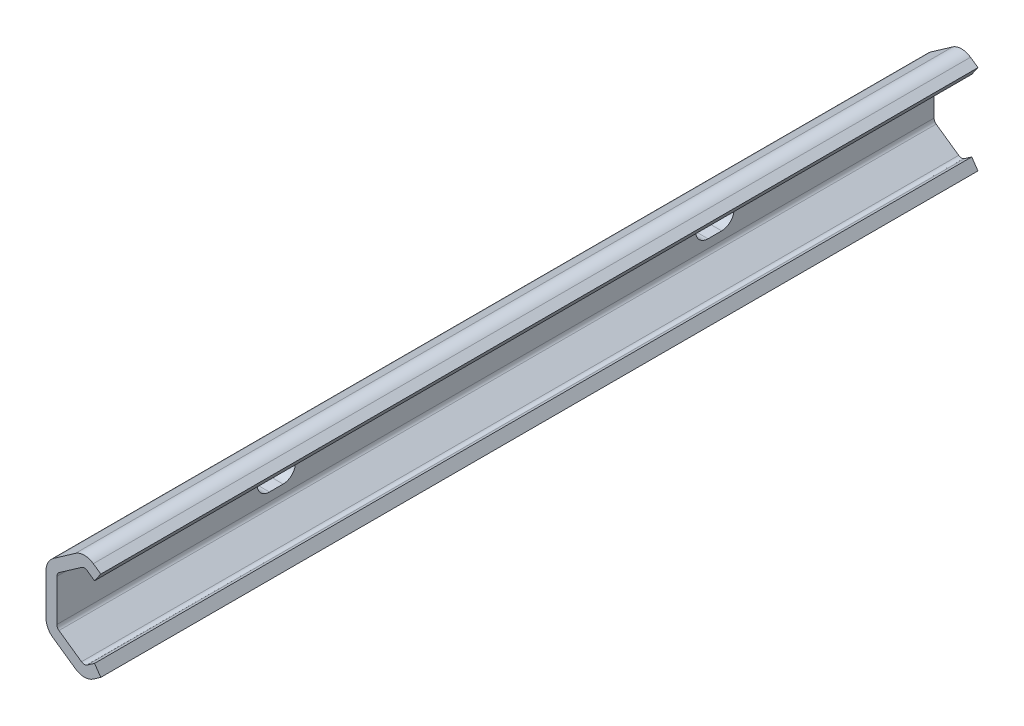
ISO-10303-21;
HEADER;
FILE_DESCRIPTION(('STEP AP214'),'2;1');
FILE_NAME('part.step','',(''),(''),'','','');
FILE_SCHEMA(('AUTOMOTIVE_DESIGN { 1 0 10303 214 1 1 1 1 }'));
ENDSEC;
DATA;
#1=APPLICATION_CONTEXT('core data for automotive mechanical design processes');
#2=APPLICATION_PROTOCOL_DEFINITION('international standard','automotive_design',2000,#1);
#3=PRODUCT_CONTEXT('',#1,'mechanical');
#4=PRODUCT('Part','Part','',(#3));
#5=PRODUCT_RELATED_PRODUCT_CATEGORY('part','',(#4));
#6=PRODUCT_DEFINITION_FORMATION('','',#4);
#7=PRODUCT_DEFINITION_CONTEXT('part definition',#1,'design');
#8=PRODUCT_DEFINITION('design','',#6,#7);
#9=PRODUCT_DEFINITION_SHAPE('','',#8);
#10=(LENGTH_UNIT() NAMED_UNIT(*) SI_UNIT(.MILLI.,.METRE.));
#11=(NAMED_UNIT(*) PLANE_ANGLE_UNIT() SI_UNIT($,.RADIAN.));
#12=(NAMED_UNIT(*) SI_UNIT($,.STERADIAN.) SOLID_ANGLE_UNIT());
#13=UNCERTAINTY_MEASURE_WITH_UNIT(LENGTH_MEASURE(1.E-05),#10,'distance_accuracy_value','');
#14=(GEOMETRIC_REPRESENTATION_CONTEXT(3) GLOBAL_UNCERTAINTY_ASSIGNED_CONTEXT((#13)) GLOBAL_UNIT_ASSIGNED_CONTEXT((#10,
#11,#12)) REPRESENTATION_CONTEXT('',''));
#15=CARTESIAN_POINT('',(0.,0.,0.));
#16=DIRECTION('',(0.,0.,1.));
#17=DIRECTION('',(1.,0.,0.));
#18=AXIS2_PLACEMENT_3D('',#15,#16,#17);
#19=CARTESIAN_POINT('',(7.52196603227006,7.45296627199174,-160.));
#20=DIRECTION('',(-0.573576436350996,-0.819152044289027,0.));
#21=DIRECTION('',(0.819152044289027,-0.573576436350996,0.));
#22=AXIS2_PLACEMENT_3D('',#19,#20,#21);
#23=PLANE('',#22);
#24=DIRECTION('',(0.819152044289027,-0.573576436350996,0.));
#25=VECTOR('',#24,1.);
#26=CARTESIAN_POINT('',(7.52196603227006,7.45296627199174,0.));
#27=LINE('',#26,#25);
#28=CARTESIAN_POINT('',(7.52196603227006,7.45296627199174,0.));
#29=VERTEX_POINT('',#28);
#30=CARTESIAN_POINT('',(8.85284712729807,6.52107329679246,0.));
#31=VERTEX_POINT('',#30);
#32=EDGE_CURVE('E309',#29,#31,#27,.T.);
#33=ORIENTED_EDGE('',*,*,#32,.F.);
#34=DIRECTION('',(0.,0.,1.));
#35=VECTOR('',#34,1.);
#36=CARTESIAN_POINT('',(7.52196603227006,7.45296627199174,-160.));
#37=LINE('',#36,#35);
#38=CARTESIAN_POINT('',(7.52196603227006,7.45296627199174,-160.));
#39=VERTEX_POINT('',#38);
#40=EDGE_CURVE('E11',#39,#29,#37,.T.);
#41=ORIENTED_EDGE('',*,*,#40,.F.);
#42=DIRECTION('',(0.819152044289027,-0.573576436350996,0.));
#43=VECTOR('',#42,1.);
#44=CARTESIAN_POINT('',(7.52196603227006,7.45296627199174,-160.));
#45=LINE('',#44,#43);
#46=CARTESIAN_POINT('',(8.85284712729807,6.52107329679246,-160.));
#47=VERTEX_POINT('',#46);
#48=EDGE_CURVE('E319',#39,#47,#45,.T.);
#49=ORIENTED_EDGE('',*,*,#48,.T.);
#50=DIRECTION('',(0.,0.,1.));
#51=VECTOR('',#50,1.);
#52=CARTESIAN_POINT('',(8.85284712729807,6.52107329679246,-160.));
#53=LINE('',#52,#51);
#54=EDGE_CURVE('E41',#47,#31,#53,.T.);
#55=ORIENTED_EDGE('',*,*,#54,.T.);
#56=EDGE_LOOP('',(#33,#41,#49,#55));
#57=FACE_BOUND('',#56,.T.);
#58=ADVANCED_FACE('F38',(#57),#23,.T.);
#59=CARTESIAN_POINT('',(7.00000000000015,6.70752152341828,-160.));
#60=DIRECTION('',(0.,0.,1.));
#61=DIRECTION('',(1.,0.,0.));
#62=AXIS2_PLACEMENT_3D('',#59,#60,#61);
#63=CYLINDRICAL_SURFACE('',#62,0.910020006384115);
#64=CARTESIAN_POINT('',(7.00000000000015,6.70752152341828,0.));
#65=DIRECTION('',(0.,0.,-1.));
#66=DIRECTION('',(-1.,0.,0.));
#67=AXIS2_PLACEMENT_3D('',#64,#65,#66);
#68=CIRCLE('',#67,0.910020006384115);
#69=CARTESIAN_POINT('',(6.47803396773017,7.4529662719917,0.));
#70=VERTEX_POINT('',#69);
#71=EDGE_CURVE('E324',#70,#29,#68,.T.);
#72=ORIENTED_EDGE('',*,*,#71,.F.);
#73=DIRECTION('',(0.,0.,1.));
#74=VECTOR('',#73,1.);
#75=CARTESIAN_POINT('',(6.47803396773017,7.4529662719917,-160.));
#76=LINE('',#75,#74);
#77=CARTESIAN_POINT('',(6.47803396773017,7.4529662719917,-160.));
#78=VERTEX_POINT('',#77);
#79=EDGE_CURVE('E47',#78,#70,#76,.T.);
#80=ORIENTED_EDGE('',*,*,#79,.F.);
#81=CARTESIAN_POINT('',(7.00000000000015,6.70752152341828,-160.));
#82=DIRECTION('',(0.,0.,-1.));
#83=DIRECTION('',(-1.,0.,0.));
#84=AXIS2_PLACEMENT_3D('',#81,#82,#83);
#85=CIRCLE('',#84,0.910020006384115);
#86=EDGE_CURVE('E395',#78,#39,#85,.T.);
#87=ORIENTED_EDGE('',*,*,#86,.T.);
#88=ORIENTED_EDGE('',*,*,#40,.T.);
#89=EDGE_LOOP('',(#72,#80,#87,#88));
#90=FACE_BOUND('',#89,.T.);
#91=ADVANCED_FACE('F541',(#90),#63,.F.);
#92=CARTESIAN_POINT('',(2.36906085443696,4.57583232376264,-160.));
#93=DIRECTION('',(0.573576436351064,-0.819152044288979,0.));
#94=DIRECTION('',(0.819152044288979,0.573576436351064,0.));
#95=AXIS2_PLACEMENT_3D('',#92,#93,#94);
#96=PLANE('',#95);
#97=DIRECTION('',(0.819152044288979,0.573576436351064,0.));
#98=VECTOR('',#97,1.);
#99=CARTESIAN_POINT('',(2.36906085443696,4.57583232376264,0.));
#100=LINE('',#99,#98);
#101=CARTESIAN_POINT('',(2.36906085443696,4.57583232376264,0.));
#102=VERTEX_POINT('',#101);
#103=EDGE_CURVE('E470',#102,#70,#100,.T.);
#104=ORIENTED_EDGE('',*,*,#103,.F.);
#105=DIRECTION('',(0.,0.,1.));
#106=VECTOR('',#105,1.);
#107=CARTESIAN_POINT('',(2.36906085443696,4.57583232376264,-160.));
#108=LINE('',#107,#106);
#109=CARTESIAN_POINT('',(2.36906085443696,4.57583232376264,-160.));
#110=VERTEX_POINT('',#109);
#111=EDGE_CURVE('E479',#110,#102,#108,.T.);
#112=ORIENTED_EDGE('',*,*,#111,.F.);
#113=DIRECTION('',(0.819152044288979,0.573576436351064,0.));
#114=VECTOR('',#113,1.);
#115=CARTESIAN_POINT('',(2.36906085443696,4.57583232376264,-160.));
#116=LINE('',#115,#114);
#117=EDGE_CURVE('E391',#110,#78,#116,.T.);
#118=ORIENTED_EDGE('',*,*,#117,.T.);
#119=ORIENTED_EDGE('',*,*,#79,.T.);
#120=EDGE_LOOP('',(#104,#112,#118,#119));
#121=FACE_BOUND('',#120,.T.);
#122=ADVANCED_FACE('F609',(#121),#96,.T.);
#123=CARTESIAN_POINT('',(3.00000000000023,3.79999999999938,-160.));
#124=DIRECTION('',(0.,0.,1.));
#125=DIRECTION('',(1.,0.,0.));
#126=AXIS2_PLACEMENT_3D('',#123,#124,#125);
#127=CYLINDRICAL_SURFACE('',#126,1.);
#128=CARTESIAN_POINT('',(3.00000000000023,3.79999999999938,0.));
#129=DIRECTION('',(0.,0.,-1.));
#130=DIRECTION('',(-1.,0.,0.));
#131=AXIS2_PLACEMENT_3D('',#128,#129,#130);
#132=CIRCLE('',#131,1.);
#133=CARTESIAN_POINT('',(2.00000000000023,3.79999999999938,0.));
#134=VERTEX_POINT('',#133);
#135=EDGE_CURVE('E466',#134,#102,#132,.T.);
#136=ORIENTED_EDGE('',*,*,#135,.F.);
#137=DIRECTION('',(0.,0.,1.));
#138=VECTOR('',#137,1.);
#139=CARTESIAN_POINT('',(2.00000000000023,3.79999999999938,-160.));
#140=LINE('',#139,#138);
#141=CARTESIAN_POINT('',(2.00000000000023,3.79999999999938,-160.));
#142=VERTEX_POINT('',#141);
#143=EDGE_CURVE('E482',#142,#134,#140,.T.);
#144=ORIENTED_EDGE('',*,*,#143,.F.);
#145=CARTESIAN_POINT('',(3.00000000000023,3.79999999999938,-160.));
#146=DIRECTION('',(0.,0.,-1.));
#147=DIRECTION('',(-1.,0.,0.));
#148=AXIS2_PLACEMENT_3D('',#145,#146,#147);
#149=CIRCLE('',#148,1.);
#150=EDGE_CURVE('E387',#142,#110,#149,.T.);
#151=ORIENTED_EDGE('',*,*,#150,.T.);
#152=ORIENTED_EDGE('',*,*,#111,.T.);
#153=EDGE_LOOP('',(#136,#144,#151,#152));
#154=FACE_BOUND('',#153,.T.);
#155=ADVANCED_FACE('F607',(#154),#127,.F.);
#156=CARTESIAN_POINT('',(2.00000000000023,-3.80000000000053,-160.));
#157=DIRECTION('',(1.,0.,0.));
#158=DIRECTION('',(0.,1.,0.));
#159=AXIS2_PLACEMENT_3D('',#156,#157,#158);
#160=PLANE('',#159);
#161=CARTESIAN_POINT('',(2.00000000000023,0.,-118.75));
#162=DIRECTION('',(1.,0.,0.));
#163=DIRECTION('',(0.,1.,0.));
#164=AXIS2_PLACEMENT_3D('',#161,#162,#163);
#165=CIRCLE('',#164,2.25);
#166=CARTESIAN_POINT('',(2.00000000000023,2.25,-118.75));
#167=VERTEX_POINT('',#166);
#168=CARTESIAN_POINT('',(2.00000000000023,-2.25,-118.75));
#169=VERTEX_POINT('',#168);
#170=EDGE_CURVE('E55',#167,#169,#165,.T.);
#171=ORIENTED_EDGE('',*,*,#170,.F.);
#172=DIRECTION('',(0.,0.,1.));
#173=VECTOR('',#172,1.);
#174=CARTESIAN_POINT('',(2.00000000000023,2.25,-118.75));
#175=LINE('',#174,#173);
#176=CARTESIAN_POINT('',(2.00000000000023,2.25,-121.25));
#177=VERTEX_POINT('',#176);
#178=EDGE_CURVE('E245',#177,#167,#175,.T.);
#179=ORIENTED_EDGE('',*,*,#178,.F.);
#180=CARTESIAN_POINT('',(2.00000000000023,0.,-121.25));
#181=DIRECTION('',(1.,0.,0.));
#182=DIRECTION('',(0.,1.,0.));
#183=AXIS2_PLACEMENT_3D('',#180,#181,#182);
#184=CIRCLE('',#183,2.25);
#185=CARTESIAN_POINT('',(2.00000000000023,-2.25,-121.25));
#186=VERTEX_POINT('',#185);
#187=EDGE_CURVE('E251',#186,#177,#184,.T.);
#188=ORIENTED_EDGE('',*,*,#187,.F.);
#189=DIRECTION('',(0.,0.,-1.));
#190=VECTOR('',#189,1.);
#191=CARTESIAN_POINT('',(2.00000000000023,-2.25,-118.75));
#192=LINE('',#191,#190);
#193=EDGE_CURVE('E260',#169,#186,#192,.T.);
#194=ORIENTED_EDGE('',*,*,#193,.F.);
#195=EDGE_LOOP('',(#171,#179,#188,#194));
#196=FACE_BOUND('',#195,.T.);
#197=CARTESIAN_POINT('',(2.00000000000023,0.,-38.75));
#198=DIRECTION('',(1.,0.,0.));
#199=DIRECTION('',(0.,1.,0.));
#200=AXIS2_PLACEMENT_3D('',#197,#198,#199);
#201=CIRCLE('',#200,2.25);
#202=CARTESIAN_POINT('',(2.00000000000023,2.25,-38.75));
#203=VERTEX_POINT('',#202);
#204=CARTESIAN_POINT('',(2.00000000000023,-2.25,-38.75));
#205=VERTEX_POINT('',#204);
#206=EDGE_CURVE('E269',#203,#205,#201,.T.);
#207=ORIENTED_EDGE('',*,*,#206,.F.);
#208=DIRECTION('',(0.,0.,1.));
#209=VECTOR('',#208,1.);
#210=CARTESIAN_POINT('',(2.00000000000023,2.25,-38.75));
#211=LINE('',#210,#209);
#212=CARTESIAN_POINT('',(2.00000000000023,2.25,-41.25));
#213=VERTEX_POINT('',#212);
#214=EDGE_CURVE('E280',#213,#203,#211,.T.);
#215=ORIENTED_EDGE('',*,*,#214,.F.);
#216=CARTESIAN_POINT('',(2.00000000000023,0.,-41.25));
#217=DIRECTION('',(1.,0.,0.));
#218=DIRECTION('',(0.,1.,0.));
#219=AXIS2_PLACEMENT_3D('',#216,#217,#218);
#220=CIRCLE('',#219,2.25);
#221=CARTESIAN_POINT('',(2.00000000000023,-2.25,-41.25));
#222=VERTEX_POINT('',#221);
#223=EDGE_CURVE('E299',#222,#213,#220,.T.);
#224=ORIENTED_EDGE('',*,*,#223,.F.);
#225=DIRECTION('',(0.,0.,-1.));
#226=VECTOR('',#225,1.);
#227=CARTESIAN_POINT('',(2.00000000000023,-2.25,-38.75));
#228=LINE('',#227,#226);
#229=EDGE_CURVE('E295',#205,#222,#228,.T.);
#230=ORIENTED_EDGE('',*,*,#229,.F.);
#231=EDGE_LOOP('',(#207,#215,#224,#230));
#232=FACE_BOUND('',#231,.T.);
#233=DIRECTION('',(0.,1.,0.));
#234=VECTOR('',#233,1.);
#235=CARTESIAN_POINT('',(2.00000000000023,-3.80000000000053,0.));
#236=LINE('',#235,#234);
#237=CARTESIAN_POINT('',(2.00000000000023,-3.80000000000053,0.));
#238=VERTEX_POINT('',#237);
#239=EDGE_CURVE('E462',#238,#134,#236,.T.);
#240=ORIENTED_EDGE('',*,*,#239,.F.);
#241=DIRECTION('',(0.,0.,1.));
#242=VECTOR('',#241,1.);
#243=CARTESIAN_POINT('',(2.00000000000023,-3.80000000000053,-160.));
#244=LINE('',#243,#242);
#245=CARTESIAN_POINT('',(2.00000000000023,-3.80000000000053,-160.));
#246=VERTEX_POINT('',#245);
#247=EDGE_CURVE('E485',#246,#238,#244,.T.);
#248=ORIENTED_EDGE('',*,*,#247,.F.);
#249=DIRECTION('',(0.,1.,0.));
#250=VECTOR('',#249,1.);
#251=CARTESIAN_POINT('',(2.00000000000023,-3.80000000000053,-160.));
#252=LINE('',#251,#250);
#253=EDGE_CURVE('E383',#246,#142,#252,.T.);
#254=ORIENTED_EDGE('',*,*,#253,.T.);
#255=ORIENTED_EDGE('',*,*,#143,.T.);
#256=EDGE_LOOP('',(#240,#248,#254,#255));
#257=FACE_BOUND('',#256,.T.);
#258=ADVANCED_FACE('F603',(#196,#232,#257),#160,.T.);
#259=CARTESIAN_POINT('',(2.86850545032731,-3.86255151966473,-160.));
#260=DIRECTION('',(0.,0.,1.));
#261=DIRECTION('',(1.,0.,0.));
#262=AXIS2_PLACEMENT_3D('',#259,#260,#261);
#263=CYLINDRICAL_SURFACE('',#262,0.870755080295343);
#264=CARTESIAN_POINT('',(2.86850545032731,-3.86255151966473,0.));
#265=DIRECTION('',(0.,0.,-1.));
#266=DIRECTION('',(-1.,0.,0.));
#267=AXIS2_PLACEMENT_3D('',#264,#265,#266);
#268=CIRCLE('',#267,0.870755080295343);
#269=CARTESIAN_POINT('',(2.36906085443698,-4.57583232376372,0.));
#270=VERTEX_POINT('',#269);
#271=EDGE_CURVE('E458',#270,#238,#268,.T.);
#272=ORIENTED_EDGE('',*,*,#271,.F.);
#273=DIRECTION('',(0.,0.,1.));
#274=VECTOR('',#273,1.);
#275=CARTESIAN_POINT('',(2.36906085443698,-4.57583232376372,-160.));
#276=LINE('',#275,#274);
#277=CARTESIAN_POINT('',(2.36906085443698,-4.57583232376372,-160.));
#278=VERTEX_POINT('',#277);
#279=EDGE_CURVE('E488',#278,#270,#276,.T.);
#280=ORIENTED_EDGE('',*,*,#279,.F.);
#281=CARTESIAN_POINT('',(2.86850545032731,-3.86255151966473,-160.));
#282=DIRECTION('',(0.,0.,-1.));
#283=DIRECTION('',(-1.,0.,0.));
#284=AXIS2_PLACEMENT_3D('',#281,#282,#283);
#285=CIRCLE('',#284,0.870755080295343);
#286=EDGE_CURVE('E379',#278,#246,#285,.T.);
#287=ORIENTED_EDGE('',*,*,#286,.T.);
#288=ORIENTED_EDGE('',*,*,#247,.T.);
#289=EDGE_LOOP('',(#272,#280,#287,#288));
#290=FACE_BOUND('',#289,.T.);
#291=ADVANCED_FACE('F599',(#290),#263,.F.);
#292=CARTESIAN_POINT('',(6.47803396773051,-7.45296627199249,-160.));
#293=DIRECTION('',(0.573576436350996,0.819152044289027,0.));
#294=DIRECTION('',(-0.819152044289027,0.573576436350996,0.));
#295=AXIS2_PLACEMENT_3D('',#292,#293,#294);
#296=PLANE('',#295);
#297=DIRECTION('',(-0.819152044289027,0.573576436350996,0.));
#298=VECTOR('',#297,1.);
#299=CARTESIAN_POINT('',(6.47803396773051,-7.45296627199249,0.));
#300=LINE('',#299,#298);
#301=CARTESIAN_POINT('',(6.47803396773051,-7.45296627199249,0.));
#302=VERTEX_POINT('',#301);
#303=EDGE_CURVE('E454',#302,#270,#300,.T.);
#304=ORIENTED_EDGE('',*,*,#303,.F.);
#305=DIRECTION('',(0.,0.,1.));
#306=VECTOR('',#305,1.);
#307=CARTESIAN_POINT('',(6.47803396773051,-7.45296627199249,-160.));
#308=LINE('',#307,#306);
#309=CARTESIAN_POINT('',(6.47803396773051,-7.45296627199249,-160.));
#310=VERTEX_POINT('',#309);
#311=EDGE_CURVE('E491',#310,#302,#308,.T.);
#312=ORIENTED_EDGE('',*,*,#311,.F.);
#313=DIRECTION('',(-0.819152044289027,0.573576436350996,0.));
#314=VECTOR('',#313,1.);
#315=CARTESIAN_POINT('',(6.47803396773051,-7.45296627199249,-160.));
#316=LINE('',#315,#314);
#317=EDGE_CURVE('E375',#310,#278,#316,.T.);
#318=ORIENTED_EDGE('',*,*,#317,.T.);
#319=ORIENTED_EDGE('',*,*,#279,.T.);
#320=EDGE_LOOP('',(#304,#312,#318,#319));
#321=FACE_BOUND('',#320,.T.);
#322=ADVANCED_FACE('F595',(#321),#296,.T.);
#323=CARTESIAN_POINT('',(7.00000000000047,-6.70752152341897,-160.));
#324=DIRECTION('',(0.,0.,1.));
#325=DIRECTION('',(1.,0.,0.));
#326=AXIS2_PLACEMENT_3D('',#323,#324,#325);
#327=CYLINDRICAL_SURFACE('',#326,0.910020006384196);
#328=CARTESIAN_POINT('',(7.00000000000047,-6.70752152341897,0.));
#329=DIRECTION('',(0.,0.,-1.));
#330=DIRECTION('',(-1.,0.,0.));
#331=AXIS2_PLACEMENT_3D('',#328,#329,#330);
#332=CIRCLE('',#331,0.910020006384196);
#333=CARTESIAN_POINT('',(7.52196603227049,-7.45296627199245,0.));
#334=VERTEX_POINT('',#333);
#335=EDGE_CURVE('E450',#334,#302,#332,.T.);
#336=ORIENTED_EDGE('',*,*,#335,.F.);
#337=DIRECTION('',(0.,0.,1.));
#338=VECTOR('',#337,1.);
#339=CARTESIAN_POINT('',(7.52196603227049,-7.45296627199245,-160.));
#340=LINE('',#339,#338);
#341=CARTESIAN_POINT('',(7.52196603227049,-7.45296627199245,-160.));
#342=VERTEX_POINT('',#341);
#343=EDGE_CURVE('E494',#342,#334,#340,.T.);
#344=ORIENTED_EDGE('',*,*,#343,.F.);
#345=CARTESIAN_POINT('',(7.00000000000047,-6.70752152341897,-160.));
#346=DIRECTION('',(0.,0.,-1.));
#347=DIRECTION('',(-1.,0.,0.));
#348=AXIS2_PLACEMENT_3D('',#345,#346,#347);
#349=CIRCLE('',#348,0.910020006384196);
#350=EDGE_CURVE('E372',#342,#310,#349,.T.);
#351=ORIENTED_EDGE('',*,*,#350,.T.);
#352=ORIENTED_EDGE('',*,*,#311,.T.);
#353=EDGE_LOOP('',(#336,#344,#351,#352));
#354=FACE_BOUND('',#353,.T.);
#355=ADVANCED_FACE('F591',(#354),#327,.F.);
#356=CARTESIAN_POINT('',(8.85284712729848,-6.52107329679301,-160.));
#357=DIRECTION('',(-0.573576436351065,0.819152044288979,0.));
#358=DIRECTION('',(-0.819152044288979,-0.573576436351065,0.));
#359=AXIS2_PLACEMENT_3D('',#356,#357,#358);
#360=PLANE('',#359);
#361=DIRECTION('',(-0.819152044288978,-0.573576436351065,0.));
#362=VECTOR('',#361,1.);
#363=CARTESIAN_POINT('',(8.85284712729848,-6.52107329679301,0.));
#364=LINE('',#363,#362);
#365=CARTESIAN_POINT('',(8.85284712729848,-6.52107329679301,0.));
#366=VERTEX_POINT('',#365);
#367=EDGE_CURVE('E446',#366,#334,#364,.T.);
#368=ORIENTED_EDGE('',*,*,#367,.F.);
#369=DIRECTION('',(0.,0.,1.));
#370=VECTOR('',#369,1.);
#371=CARTESIAN_POINT('',(8.85284712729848,-6.52107329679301,-160.));
#372=LINE('',#371,#370);
#373=CARTESIAN_POINT('',(8.85284712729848,-6.52107329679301,-160.));
#374=VERTEX_POINT('',#373);
#375=EDGE_CURVE('E497',#374,#366,#372,.T.);
#376=ORIENTED_EDGE('',*,*,#375,.F.);
#377=DIRECTION('',(-0.819152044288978,-0.573576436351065,0.));
#378=VECTOR('',#377,1.);
#379=CARTESIAN_POINT('',(8.85284712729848,-6.52107329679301,-160.));
#380=LINE('',#379,#378);
#381=EDGE_CURVE('E368',#374,#342,#380,.T.);
#382=ORIENTED_EDGE('',*,*,#381,.T.);
#383=ORIENTED_EDGE('',*,*,#343,.T.);
#384=EDGE_LOOP('',(#368,#376,#382,#383));
#385=FACE_BOUND('',#384,.T.);
#386=ADVANCED_FACE('F587',(#385),#360,.T.);
#387=CARTESIAN_POINT('',(10.0000000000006,-8.15937738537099,-160.));
#388=DIRECTION('',(0.819152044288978,0.573576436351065,0.));
#389=DIRECTION('',(-0.573576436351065,0.819152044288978,0.));
#390=AXIS2_PLACEMENT_3D('',#387,#388,#389);
#391=PLANE('',#390);
#392=DIRECTION('',(-0.573576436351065,0.819152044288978,0.));
#393=VECTOR('',#392,1.);
#394=CARTESIAN_POINT('',(10.0000000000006,-8.15937738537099,0.));
#395=LINE('',#394,#393);
#396=CARTESIAN_POINT('',(10.0000000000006,-8.15937738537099,0.));
#397=VERTEX_POINT('',#396);
#398=EDGE_CURVE('E442',#397,#366,#395,.T.);
#399=ORIENTED_EDGE('',*,*,#398,.F.);
#400=DIRECTION('',(0.,0.,1.));
#401=VECTOR('',#400,1.);
#402=CARTESIAN_POINT('',(10.0000000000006,-8.15937738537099,-160.));
#403=LINE('',#402,#401);
#404=CARTESIAN_POINT('',(10.0000000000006,-8.15937738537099,-160.));
#405=VERTEX_POINT('',#404);
#406=EDGE_CURVE('E500',#405,#397,#403,.T.);
#407=ORIENTED_EDGE('',*,*,#406,.F.);
#408=DIRECTION('',(-0.573576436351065,0.819152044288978,0.));
#409=VECTOR('',#408,1.);
#410=CARTESIAN_POINT('',(10.0000000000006,-8.15937738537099,-160.));
#411=LINE('',#410,#409);
#412=EDGE_CURVE('E364',#405,#374,#411,.T.);
#413=ORIENTED_EDGE('',*,*,#412,.T.);
#414=ORIENTED_EDGE('',*,*,#375,.T.);
#415=EDGE_LOOP('',(#399,#407,#413,#414));
#416=FACE_BOUND('',#415,.T.);
#417=ADVANCED_FACE('F583',(#416),#391,.T.);
#418=CARTESIAN_POINT('',(8.63210894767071,-9.11718501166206,-160.));
#419=DIRECTION('',(0.573576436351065,-0.819152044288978,0.));
#420=DIRECTION('',(0.819152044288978,0.573576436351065,0.));
#421=AXIS2_PLACEMENT_3D('',#418,#419,#420);
#422=PLANE('',#421);
#423=DIRECTION('',(0.819152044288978,0.573576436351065,0.));
#424=VECTOR('',#423,1.);
#425=CARTESIAN_POINT('',(8.63210894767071,-9.11718501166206,0.));
#426=LINE('',#425,#424);
#427=CARTESIAN_POINT('',(8.63210894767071,-9.11718501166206,0.));
#428=VERTEX_POINT('',#427);
#429=EDGE_CURVE('E438',#428,#397,#426,.T.);
#430=ORIENTED_EDGE('',*,*,#429,.F.);
#431=DIRECTION('',(0.,0.,1.));
#432=VECTOR('',#431,1.);
#433=CARTESIAN_POINT('',(8.63210894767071,-9.11718501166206,-160.));
#434=LINE('',#433,#432);
#435=CARTESIAN_POINT('',(8.63210894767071,-9.11718501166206,-160.));
#436=VERTEX_POINT('',#435);
#437=EDGE_CURVE('E503',#436,#428,#434,.T.);
#438=ORIENTED_EDGE('',*,*,#437,.F.);
#439=DIRECTION('',(0.819152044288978,0.573576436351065,0.));
#440=VECTOR('',#439,1.);
#441=CARTESIAN_POINT('',(8.63210894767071,-9.11718501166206,-160.));
#442=LINE('',#441,#440);
#443=EDGE_CURVE('E360',#436,#405,#442,.T.);
#444=ORIENTED_EDGE('',*,*,#443,.T.);
#445=ORIENTED_EDGE('',*,*,#406,.T.);
#446=EDGE_LOOP('',(#430,#438,#444,#445));
#447=FACE_BOUND('',#446,.T.);
#448=ADVANCED_FACE('F579',(#447),#422,.T.);
#449=CARTESIAN_POINT('',(7.00000000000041,-6.78629187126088,-160.));
#450=DIRECTION('',(0.,0.,1.));
#451=DIRECTION('',(1.,0.,0.));
#452=AXIS2_PLACEMENT_3D('',#449,#450,#451);
#453=CYLINDRICAL_SURFACE('',#452,2.84549511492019);
#454=CARTESIAN_POINT('',(7.00000000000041,-6.78629187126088,0.));
#455=DIRECTION('',(0.,0.,1.));
#456=DIRECTION('',(1.,0.,0.));
#457=AXIS2_PLACEMENT_3D('',#454,#455,#456);
#458=CIRCLE('',#457,2.84549511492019);
#459=CARTESIAN_POINT('',(5.36789105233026,-9.11718501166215,0.));
#460=VERTEX_POINT('',#459);
#461=EDGE_CURVE('E434',#460,#428,#458,.T.);
#462=ORIENTED_EDGE('',*,*,#461,.F.);
#463=DIRECTION('',(0.,0.,1.));
#464=VECTOR('',#463,1.);
#465=CARTESIAN_POINT('',(5.36789105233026,-9.11718501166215,-160.));
#466=LINE('',#465,#464);
#467=CARTESIAN_POINT('',(5.36789105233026,-9.11718501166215,-160.));
#468=VERTEX_POINT('',#467);
#469=EDGE_CURVE('E506',#468,#460,#466,.T.);
#470=ORIENTED_EDGE('',*,*,#469,.F.);
#471=CARTESIAN_POINT('',(7.00000000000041,-6.78629187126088,-160.));
#472=DIRECTION('',(0.,0.,1.));
#473=DIRECTION('',(1.,0.,0.));
#474=AXIS2_PLACEMENT_3D('',#471,#472,#473);
#475=CIRCLE('',#474,2.84549511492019);
#476=EDGE_CURVE('E356',#468,#436,#475,.T.);
#477=ORIENTED_EDGE('',*,*,#476,.T.);
#478=ORIENTED_EDGE('',*,*,#437,.T.);
#479=EDGE_LOOP('',(#462,#470,#477,#478));
#480=FACE_BOUND('',#479,.T.);
#481=ADVANCED_FACE('F575',(#480),#453,.T.);
#482=CARTESIAN_POINT('',(1.382718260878,-6.32673698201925,-160.));
#483=DIRECTION('',(-0.573576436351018,-0.819152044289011,0.));
#484=DIRECTION('',(0.819152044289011,-0.573576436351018,0.));
#485=AXIS2_PLACEMENT_3D('',#482,#483,#484);
#486=PLANE('',#485);
#487=DIRECTION('',(0.819152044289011,-0.573576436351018,0.));
#488=VECTOR('',#487,1.);
#489=CARTESIAN_POINT('',(1.382718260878,-6.32673698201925,0.));
#490=LINE('',#489,#488);
#491=CARTESIAN_POINT('',(1.382718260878,-6.32673698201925,0.));
#492=VERTEX_POINT('',#491);
#493=EDGE_CURVE('E430',#492,#460,#490,.T.);
#494=ORIENTED_EDGE('',*,*,#493,.F.);
#495=DIRECTION('',(0.,0.,1.));
#496=VECTOR('',#495,1.);
#497=CARTESIAN_POINT('',(1.382718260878,-6.32673698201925,-160.));
#498=LINE('',#497,#496);
#499=CARTESIAN_POINT('',(1.382718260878,-6.32673698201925,-160.));
#500=VERTEX_POINT('',#499);
#501=EDGE_CURVE('E509',#500,#492,#498,.T.);
#502=ORIENTED_EDGE('',*,*,#501,.F.);
#503=DIRECTION('',(0.819152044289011,-0.573576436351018,0.));
#504=VECTOR('',#503,1.);
#505=CARTESIAN_POINT('',(1.382718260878,-6.32673698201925,-160.));
#506=LINE('',#505,#504);
#507=EDGE_CURVE('E352',#500,#468,#506,.T.);
#508=ORIENTED_EDGE('',*,*,#507,.T.);
#509=ORIENTED_EDGE('',*,*,#469,.T.);
#510=EDGE_LOOP('',(#494,#502,#508,#509));
#511=FACE_BOUND('',#510,.T.);
#512=ADVANCED_FACE('F571',(#511),#486,.T.);
#513=CARTESIAN_POINT('',(3.00000000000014,-3.80000000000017,-160.));
#514=DIRECTION('',(0.,0.,1.));
#515=DIRECTION('',(1.,0.,0.));
#516=AXIS2_PLACEMENT_3D('',#513,#514,#515);
#517=CYLINDRICAL_SURFACE('',#516,3.00000000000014);
#518=CARTESIAN_POINT('',(3.00000000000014,-3.80000000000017,0.));
#519=DIRECTION('',(0.,0.,1.));
#520=DIRECTION('',(1.,0.,0.));
#521=AXIS2_PLACEMENT_3D('',#518,#519,#520);
#522=CIRCLE('',#521,3.00000000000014);
#523=CARTESIAN_POINT('',(0.,-3.80000000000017,0.));
#524=VERTEX_POINT('',#523);
#525=EDGE_CURVE('E426',#524,#492,#522,.T.);
#526=ORIENTED_EDGE('',*,*,#525,.F.);
#527=DIRECTION('',(0.,0.,1.));
#528=VECTOR('',#527,1.);
#529=CARTESIAN_POINT('',(0.,-3.80000000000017,-160.));
#530=LINE('',#529,#528);
#531=CARTESIAN_POINT('',(0.,-3.80000000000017,-160.));
#532=VERTEX_POINT('',#531);
#533=EDGE_CURVE('E512',#532,#524,#530,.T.);
#534=ORIENTED_EDGE('',*,*,#533,.F.);
#535=CARTESIAN_POINT('',(3.00000000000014,-3.80000000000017,-160.));
#536=DIRECTION('',(0.,0.,1.));
#537=DIRECTION('',(1.,0.,0.));
#538=AXIS2_PLACEMENT_3D('',#535,#536,#537);
#539=CIRCLE('',#538,3.00000000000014);
#540=EDGE_CURVE('E348',#532,#500,#539,.T.);
#541=ORIENTED_EDGE('',*,*,#540,.T.);
#542=ORIENTED_EDGE('',*,*,#501,.T.);
#543=EDGE_LOOP('',(#526,#534,#541,#542));
#544=FACE_BOUND('',#543,.T.);
#545=ADVANCED_FACE('F567',(#544),#517,.T.);
#546=CARTESIAN_POINT('',(0.,3.8,-160.));
#547=DIRECTION('',(-1.,0.,0.));
#548=DIRECTION('',(0.,-1.,0.));
#549=AXIS2_PLACEMENT_3D('',#546,#547,#548);
#550=PLANE('',#549);
#551=CARTESIAN_POINT('',(0.,0.,-118.75));
#552=DIRECTION('',(1.,0.,0.));
#553=DIRECTION('',(0.,1.,0.));
#554=AXIS2_PLACEMENT_3D('',#551,#552,#553);
#555=CIRCLE('',#554,2.25);
#556=CARTESIAN_POINT('',(0.,2.25,-118.75));
#557=VERTEX_POINT('',#556);
#558=CARTESIAN_POINT('',(0.,-2.25,-118.75));
#559=VERTEX_POINT('',#558);
#560=EDGE_CURVE('E226',#557,#559,#555,.T.);
#561=ORIENTED_EDGE('',*,*,#560,.T.);
#562=DIRECTION('',(0.,0.,-1.));
#563=VECTOR('',#562,1.);
#564=CARTESIAN_POINT('',(0.,-2.25,-118.75));
#565=LINE('',#564,#563);
#566=CARTESIAN_POINT('',(0.,-2.25,-121.25));
#567=VERTEX_POINT('',#566);
#568=EDGE_CURVE('E236',#559,#567,#565,.T.);
#569=ORIENTED_EDGE('',*,*,#568,.T.);
#570=CARTESIAN_POINT('',(0.,0.,-121.25));
#571=DIRECTION('',(1.,0.,0.));
#572=DIRECTION('',(0.,1.,0.));
#573=AXIS2_PLACEMENT_3D('',#570,#571,#572);
#574=CIRCLE('',#573,2.25);
#575=CARTESIAN_POINT('',(0.,2.25,-121.25));
#576=VERTEX_POINT('',#575);
#577=EDGE_CURVE('E63',#567,#576,#574,.T.);
#578=ORIENTED_EDGE('',*,*,#577,.T.);
#579=DIRECTION('',(0.,0.,1.));
#580=VECTOR('',#579,1.);
#581=CARTESIAN_POINT('',(0.,2.25,-118.75));
#582=LINE('',#581,#580);
#583=EDGE_CURVE('E233',#576,#557,#582,.T.);
#584=ORIENTED_EDGE('',*,*,#583,.T.);
#585=EDGE_LOOP('',(#561,#569,#578,#584));
#586=FACE_BOUND('',#585,.T.);
#587=CARTESIAN_POINT('',(0.,0.,-38.75));
#588=DIRECTION('',(1.,0.,0.));
#589=DIRECTION('',(0.,1.,0.));
#590=AXIS2_PLACEMENT_3D('',#587,#588,#589);
#591=CIRCLE('',#590,2.25);
#592=CARTESIAN_POINT('',(0.,2.25,-38.75));
#593=VERTEX_POINT('',#592);
#594=CARTESIAN_POINT('',(0.,-2.25,-38.75));
#595=VERTEX_POINT('',#594);
#596=EDGE_CURVE('E275',#593,#595,#591,.T.);
#597=ORIENTED_EDGE('',*,*,#596,.T.);
#598=DIRECTION('',(0.,0.,-1.));
#599=VECTOR('',#598,1.);
#600=CARTESIAN_POINT('',(0.,-2.25,-38.75));
#601=LINE('',#600,#599);
#602=CARTESIAN_POINT('',(0.,-2.25,-41.25));
#603=VERTEX_POINT('',#602);
#604=EDGE_CURVE('E279',#595,#603,#601,.T.);
#605=ORIENTED_EDGE('',*,*,#604,.T.);
#606=CARTESIAN_POINT('',(0.,0.,-41.25));
#607=DIRECTION('',(1.,0.,0.));
#608=DIRECTION('',(0.,1.,0.));
#609=AXIS2_PLACEMENT_3D('',#606,#607,#608);
#610=CIRCLE('',#609,2.25);
#611=CARTESIAN_POINT('',(0.,2.25,-41.25));
#612=VERTEX_POINT('',#611);
#613=EDGE_CURVE('E284',#603,#612,#610,.T.);
#614=ORIENTED_EDGE('',*,*,#613,.T.);
#615=DIRECTION('',(0.,0.,1.));
#616=VECTOR('',#615,1.);
#617=CARTESIAN_POINT('',(0.,2.25,-38.75));
#618=LINE('',#617,#616);
#619=EDGE_CURVE('E288',#612,#593,#618,.T.);
#620=ORIENTED_EDGE('',*,*,#619,.T.);
#621=EDGE_LOOP('',(#597,#605,#614,#620));
#622=FACE_BOUND('',#621,.T.);
#623=DIRECTION('',(0.,-1.,0.));
#624=VECTOR('',#623,1.);
#625=CARTESIAN_POINT('',(0.,3.8,0.));
#626=LINE('',#625,#624);
#627=CARTESIAN_POINT('',(0.,3.8,0.));
#628=VERTEX_POINT('',#627);
#629=EDGE_CURVE('E422',#628,#524,#626,.T.);
#630=ORIENTED_EDGE('',*,*,#629,.F.);
#631=DIRECTION('',(0.,0.,1.));
#632=VECTOR('',#631,1.);
#633=CARTESIAN_POINT('',(0.,3.8,-160.));
#634=LINE('',#633,#632);
#635=CARTESIAN_POINT('',(0.,3.8,-160.));
#636=VERTEX_POINT('',#635);
#637=EDGE_CURVE('E515',#636,#628,#634,.T.);
#638=ORIENTED_EDGE('',*,*,#637,.F.);
#639=DIRECTION('',(0.,-1.,0.));
#640=VECTOR('',#639,1.);
#641=CARTESIAN_POINT('',(0.,3.8,-160.));
#642=LINE('',#641,#640);
#643=EDGE_CURVE('E344',#636,#532,#642,.T.);
#644=ORIENTED_EDGE('',*,*,#643,.T.);
#645=ORIENTED_EDGE('',*,*,#533,.T.);
#646=EDGE_LOOP('',(#630,#638,#644,#645));
#647=FACE_BOUND('',#646,.T.);
#648=ADVANCED_FACE('F241',(#586,#622,#647),#550,.T.);
#649=CARTESIAN_POINT('',(3.24635715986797,3.66518480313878,-160.));
#650=DIRECTION('',(0.,0.,1.));
#651=DIRECTION('',(1.,0.,0.));
#652=AXIS2_PLACEMENT_3D('',#649,#650,#651);
#653=CYLINDRICAL_SURFACE('',#652,3.24915526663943);
#654=CARTESIAN_POINT('',(3.24635715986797,3.66518480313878,0.));
#655=DIRECTION('',(0.,0.,1.));
#656=DIRECTION('',(1.,0.,0.));
#657=AXIS2_PLACEMENT_3D('',#654,#655,#656);
#658=CIRCLE('',#657,3.24915526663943);
#659=CARTESIAN_POINT('',(1.38271826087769,6.32673698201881,0.));
#660=VERTEX_POINT('',#659);
#661=EDGE_CURVE('E418',#660,#628,#658,.T.);
#662=ORIENTED_EDGE('',*,*,#661,.F.);
#663=DIRECTION('',(0.,0.,1.));
#664=VECTOR('',#663,1.);
#665=CARTESIAN_POINT('',(1.38271826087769,6.32673698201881,-160.));
#666=LINE('',#665,#664);
#667=CARTESIAN_POINT('',(1.38271826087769,6.32673698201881,-160.));
#668=VERTEX_POINT('',#667);
#669=EDGE_CURVE('E518',#668,#660,#666,.T.);
#670=ORIENTED_EDGE('',*,*,#669,.F.);
#671=CARTESIAN_POINT('',(3.24635715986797,3.66518480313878,-160.));
#672=DIRECTION('',(0.,0.,1.));
#673=DIRECTION('',(1.,0.,0.));
#674=AXIS2_PLACEMENT_3D('',#671,#672,#673);
#675=CIRCLE('',#674,3.24915526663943);
#676=EDGE_CURVE('E340',#668,#636,#675,.T.);
#677=ORIENTED_EDGE('',*,*,#676,.T.);
#678=ORIENTED_EDGE('',*,*,#637,.T.);
#679=EDGE_LOOP('',(#662,#670,#677,#678));
#680=FACE_BOUND('',#679,.T.);
#681=ADVANCED_FACE('F560',(#680),#653,.T.);
#682=CARTESIAN_POINT('',(5.36789105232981,9.11718501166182,-160.));
#683=DIRECTION('',(-0.573576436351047,0.819152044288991,0.));
#684=DIRECTION('',(-0.819152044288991,-0.573576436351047,0.));
#685=AXIS2_PLACEMENT_3D('',#682,#683,#684);
#686=PLANE('',#685);
#687=DIRECTION('',(-0.819152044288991,-0.573576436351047,0.));
#688=VECTOR('',#687,1.);
#689=CARTESIAN_POINT('',(5.36789105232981,9.11718501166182,0.));
#690=LINE('',#689,#688);
#691=CARTESIAN_POINT('',(5.36789105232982,9.1171850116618,0.));
#692=VERTEX_POINT('',#691);
#693=EDGE_CURVE('E414',#692,#660,#690,.T.);
#694=ORIENTED_EDGE('',*,*,#693,.F.);
#695=DIRECTION('',(0.,0.,1.));
#696=VECTOR('',#695,1.);
#697=CARTESIAN_POINT('',(5.36789105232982,9.1171850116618,-160.));
#698=LINE('',#697,#696);
#699=CARTESIAN_POINT('',(5.36789105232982,9.1171850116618,-160.));
#700=VERTEX_POINT('',#699);
#701=EDGE_CURVE('E521',#700,#692,#698,.T.);
#702=ORIENTED_EDGE('',*,*,#701,.F.);
#703=DIRECTION('',(-0.819152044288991,-0.573576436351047,0.));
#704=VECTOR('',#703,1.);
#705=CARTESIAN_POINT('',(5.36789105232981,9.11718501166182,-160.));
#706=LINE('',#705,#704);
#707=EDGE_CURVE('E336',#700,#668,#706,.T.);
#708=ORIENTED_EDGE('',*,*,#707,.T.);
#709=ORIENTED_EDGE('',*,*,#669,.T.);
#710=EDGE_LOOP('',(#694,#702,#708,#709));
#711=FACE_BOUND('',#710,.T.);
#712=ADVANCED_FACE('F556',(#711),#686,.T.);
#713=CARTESIAN_POINT('',(7.,6.78629187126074,-160.));
#714=DIRECTION('',(0.,0.,1.));
#715=DIRECTION('',(1.,0.,0.));
#716=AXIS2_PLACEMENT_3D('',#713,#714,#715);
#717=CYLINDRICAL_SURFACE('',#716,2.84549511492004);
#718=CARTESIAN_POINT('',(7.,6.78629187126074,0.));
#719=DIRECTION('',(0.,0.,1.));
#720=DIRECTION('',(1.,0.,0.));
#721=AXIS2_PLACEMENT_3D('',#718,#719,#720);
#722=CIRCLE('',#721,2.84549511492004);
#723=CARTESIAN_POINT('',(8.63210894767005,9.11718501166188,0.));
#724=VERTEX_POINT('',#723);
#725=EDGE_CURVE('E410',#724,#692,#722,.T.);
#726=ORIENTED_EDGE('',*,*,#725,.F.);
#727=DIRECTION('',(0.,0.,1.));
#728=VECTOR('',#727,1.);
#729=CARTESIAN_POINT('',(8.63210894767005,9.11718501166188,-160.));
#730=LINE('',#729,#728);
#731=CARTESIAN_POINT('',(8.63210894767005,9.11718501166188,-160.));
#732=VERTEX_POINT('',#731);
#733=EDGE_CURVE('E523',#732,#724,#730,.T.);
#734=ORIENTED_EDGE('',*,*,#733,.F.);
#735=CARTESIAN_POINT('',(7.,6.78629187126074,-160.));
#736=DIRECTION('',(0.,0.,1.));
#737=DIRECTION('',(1.,0.,0.));
#738=AXIS2_PLACEMENT_3D('',#735,#736,#737);
#739=CIRCLE('',#738,2.84549511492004);
#740=EDGE_CURVE('E332',#732,#700,#739,.T.);
#741=ORIENTED_EDGE('',*,*,#740,.T.);
#742=ORIENTED_EDGE('',*,*,#701,.T.);
#743=EDGE_LOOP('',(#726,#734,#741,#742));
#744=FACE_BOUND('',#743,.T.);
#745=ADVANCED_FACE('F554',(#744),#717,.T.);
#746=CARTESIAN_POINT('',(10.0000000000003,8.1593773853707,-160.));
#747=DIRECTION('',(0.573576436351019,0.819152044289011,0.));
#748=DIRECTION('',(-0.819152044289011,0.573576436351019,0.));
#749=AXIS2_PLACEMENT_3D('',#746,#747,#748);
#750=PLANE('',#749);
#751=DIRECTION('',(-0.819152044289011,0.573576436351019,0.));
#752=VECTOR('',#751,1.);
#753=CARTESIAN_POINT('',(10.0000000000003,8.1593773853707,0.));
#754=LINE('',#753,#752);
#755=CARTESIAN_POINT('',(10.0000000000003,8.1593773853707,0.));
#756=VERTEX_POINT('',#755);
#757=EDGE_CURVE('E406',#756,#724,#754,.T.);
#758=ORIENTED_EDGE('',*,*,#757,.F.);
#759=DIRECTION('',(0.,0.,1.));
#760=VECTOR('',#759,1.);
#761=CARTESIAN_POINT('',(10.0000000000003,8.1593773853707,-160.));
#762=LINE('',#761,#760);
#763=CARTESIAN_POINT('',(10.0000000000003,8.1593773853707,-160.));
#764=VERTEX_POINT('',#763);
#765=EDGE_CURVE('E525',#764,#756,#762,.T.);
#766=ORIENTED_EDGE('',*,*,#765,.F.);
#767=DIRECTION('',(-0.819152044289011,0.573576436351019,0.));
#768=VECTOR('',#767,1.);
#769=CARTESIAN_POINT('',(10.0000000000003,8.1593773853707,-160.));
#770=LINE('',#769,#768);
#771=EDGE_CURVE('E328',#764,#732,#770,.T.);
#772=ORIENTED_EDGE('',*,*,#771,.T.);
#773=ORIENTED_EDGE('',*,*,#733,.T.);
#774=EDGE_LOOP('',(#758,#766,#772,#773));
#775=FACE_BOUND('',#774,.T.);
#776=ADVANCED_FACE('F550',(#775),#750,.T.);
#777=CARTESIAN_POINT('',(8.85284712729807,6.52107329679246,-160.));
#778=DIRECTION('',(0.819152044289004,-0.573576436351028,0.));
#779=DIRECTION('',(0.573576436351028,0.819152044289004,0.));
#780=AXIS2_PLACEMENT_3D('',#777,#778,#779);
#781=PLANE('',#780);
#782=DIRECTION('',(0.573576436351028,0.819152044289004,0.));
#783=VECTOR('',#782,1.);
#784=CARTESIAN_POINT('',(8.85284712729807,6.52107329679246,0.));
#785=LINE('',#784,#783);
#786=EDGE_CURVE('E402',#31,#756,#785,.T.);
#787=ORIENTED_EDGE('',*,*,#786,.F.);
#788=ORIENTED_EDGE('',*,*,#54,.F.);
#789=DIRECTION('',(0.573576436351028,0.819152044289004,0.));
#790=VECTOR('',#789,1.);
#791=CARTESIAN_POINT('',(8.85284712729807,6.52107329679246,-160.));
#792=LINE('',#791,#790);
#793=EDGE_CURVE('E323',#47,#764,#792,.T.);
#794=ORIENTED_EDGE('',*,*,#793,.T.);
#795=ORIENTED_EDGE('',*,*,#765,.T.);
#796=EDGE_LOOP('',(#787,#788,#794,#795));
#797=FACE_BOUND('',#796,.T.);
#798=ADVANCED_FACE('F535',(#797),#781,.T.);
#799=CARTESIAN_POINT('',(7.,6.78629187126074,-160.));
#800=DIRECTION('',(0.,0.,1.));
#801=DIRECTION('',(1.,0.,0.));
#802=AXIS2_PLACEMENT_3D('',#799,#800,#801);
#803=PLANE('',#802);
#804=ORIENTED_EDGE('',*,*,#48,.F.);
#805=ORIENTED_EDGE('',*,*,#86,.F.);
#806=ORIENTED_EDGE('',*,*,#117,.F.);
#807=ORIENTED_EDGE('',*,*,#150,.F.);
#808=ORIENTED_EDGE('',*,*,#253,.F.);
#809=ORIENTED_EDGE('',*,*,#286,.F.);
#810=ORIENTED_EDGE('',*,*,#317,.F.);
#811=ORIENTED_EDGE('',*,*,#350,.F.);
#812=ORIENTED_EDGE('',*,*,#381,.F.);
#813=ORIENTED_EDGE('',*,*,#412,.F.);
#814=ORIENTED_EDGE('',*,*,#443,.F.);
#815=ORIENTED_EDGE('',*,*,#476,.F.);
#816=ORIENTED_EDGE('',*,*,#507,.F.);
#817=ORIENTED_EDGE('',*,*,#540,.F.);
#818=ORIENTED_EDGE('',*,*,#643,.F.);
#819=ORIENTED_EDGE('',*,*,#676,.F.);
#820=ORIENTED_EDGE('',*,*,#707,.F.);
#821=ORIENTED_EDGE('',*,*,#740,.F.);
#822=ORIENTED_EDGE('',*,*,#771,.F.);
#823=ORIENTED_EDGE('',*,*,#793,.F.);
#824=EDGE_LOOP('',(#804,#805,#806,#807,#808,#809,#810,#811,#812,#813,#814,#815,#816,#817,#818,
#819,#820,#821,#822,#823));
#825=FACE_BOUND('',#824,.T.);
#826=ADVANCED_FACE('F544',(#825),#803,.F.);
#827=CARTESIAN_POINT('',(7.,6.78629187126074,0.));
#828=DIRECTION('',(0.,0.,1.));
#829=DIRECTION('',(1.,0.,0.));
#830=AXIS2_PLACEMENT_3D('',#827,#828,#829);
#831=PLANE('',#830);
#832=ORIENTED_EDGE('',*,*,#32,.T.);
#833=ORIENTED_EDGE('',*,*,#786,.T.);
#834=ORIENTED_EDGE('',*,*,#757,.T.);
#835=ORIENTED_EDGE('',*,*,#725,.T.);
#836=ORIENTED_EDGE('',*,*,#693,.T.);
#837=ORIENTED_EDGE('',*,*,#661,.T.);
#838=ORIENTED_EDGE('',*,*,#629,.T.);
#839=ORIENTED_EDGE('',*,*,#525,.T.);
#840=ORIENTED_EDGE('',*,*,#493,.T.);
#841=ORIENTED_EDGE('',*,*,#461,.T.);
#842=ORIENTED_EDGE('',*,*,#429,.T.);
#843=ORIENTED_EDGE('',*,*,#398,.T.);
#844=ORIENTED_EDGE('',*,*,#367,.T.);
#845=ORIENTED_EDGE('',*,*,#335,.T.);
#846=ORIENTED_EDGE('',*,*,#303,.T.);
#847=ORIENTED_EDGE('',*,*,#271,.T.);
#848=ORIENTED_EDGE('',*,*,#239,.T.);
#849=ORIENTED_EDGE('',*,*,#135,.T.);
#850=ORIENTED_EDGE('',*,*,#103,.T.);
#851=ORIENTED_EDGE('',*,*,#71,.T.);
#852=EDGE_LOOP('',(#832,#833,#834,#835,#836,#837,#838,#839,#840,#841,#842,#843,#844,#845,#846,
#847,#848,#849,#850,#851));
#853=FACE_BOUND('',#852,.T.);
#854=ADVANCED_FACE('F537',(#853),#831,.T.);
#855=CARTESIAN_POINT('',(0.,0.,-38.75));
#856=DIRECTION('',(1.,0.,0.));
#857=DIRECTION('',(0.,1.,0.));
#858=AXIS2_PLACEMENT_3D('',#855,#856,#857);
#859=CYLINDRICAL_SURFACE('',#858,2.25);
#860=ORIENTED_EDGE('',*,*,#206,.T.);
#861=DIRECTION('',(1.,0.,0.));
#862=VECTOR('',#861,1.);
#863=CARTESIAN_POINT('',(0.,-2.25,-38.75));
#864=LINE('',#863,#862);
#865=EDGE_CURVE('E292',#595,#205,#864,.T.);
#866=ORIENTED_EDGE('',*,*,#865,.F.);
#867=ORIENTED_EDGE('',*,*,#596,.F.);
#868=DIRECTION('',(1.,0.,0.));
#869=VECTOR('',#868,1.);
#870=CARTESIAN_POINT('',(0.,2.25,-38.75));
#871=LINE('',#870,#869);
#872=EDGE_CURVE('E306',#593,#203,#871,.T.);
#873=ORIENTED_EDGE('',*,*,#872,.T.);
#874=EDGE_LOOP('',(#860,#866,#867,#873));
#875=FACE_BOUND('',#874,.T.);
#876=ADVANCED_FACE('F760',(#875),#859,.F.);
#877=CARTESIAN_POINT('',(0.,2.25,-38.75));
#878=DIRECTION('',(0.,1.,0.));
#879=DIRECTION('',(0.,0.,1.));
#880=AXIS2_PLACEMENT_3D('',#877,#878,#879);
#881=PLANE('',#880);
#882=ORIENTED_EDGE('',*,*,#214,.T.);
#883=ORIENTED_EDGE('',*,*,#872,.F.);
#884=ORIENTED_EDGE('',*,*,#619,.F.);
#885=DIRECTION('',(1.,0.,0.));
#886=VECTOR('',#885,1.);
#887=CARTESIAN_POINT('',(0.,2.25,-41.25));
#888=LINE('',#887,#886);
#889=EDGE_CURVE('E310',#612,#213,#888,.T.);
#890=ORIENTED_EDGE('',*,*,#889,.T.);
#891=EDGE_LOOP('',(#882,#883,#884,#890));
#892=FACE_BOUND('',#891,.T.);
#893=ADVANCED_FACE('F768',(#892),#881,.F.);
#894=CARTESIAN_POINT('',(0.,0.,-41.25));
#895=DIRECTION('',(1.,0.,0.));
#896=DIRECTION('',(0.,1.,0.));
#897=AXIS2_PLACEMENT_3D('',#894,#895,#896);
#898=CYLINDRICAL_SURFACE('',#897,2.25);
#899=ORIENTED_EDGE('',*,*,#223,.T.);
#900=ORIENTED_EDGE('',*,*,#889,.F.);
#901=ORIENTED_EDGE('',*,*,#613,.F.);
#902=DIRECTION('',(1.,0.,0.));
#903=VECTOR('',#902,1.);
#904=CARTESIAN_POINT('',(0.,-2.25,-41.25));
#905=LINE('',#904,#903);
#906=EDGE_CURVE('E313',#603,#222,#905,.T.);
#907=ORIENTED_EDGE('',*,*,#906,.T.);
#908=EDGE_LOOP('',(#899,#900,#901,#907));
#909=FACE_BOUND('',#908,.T.);
#910=ADVANCED_FACE('F777',(#909),#898,.F.);
#911=CARTESIAN_POINT('',(0.,-2.25,-38.75));
#912=DIRECTION('',(0.,-1.,0.));
#913=DIRECTION('',(0.,0.,-1.));
#914=AXIS2_PLACEMENT_3D('',#911,#912,#913);
#915=PLANE('',#914);
#916=ORIENTED_EDGE('',*,*,#229,.T.);
#917=ORIENTED_EDGE('',*,*,#906,.F.);
#918=ORIENTED_EDGE('',*,*,#604,.F.);
#919=ORIENTED_EDGE('',*,*,#865,.T.);
#920=EDGE_LOOP('',(#916,#917,#918,#919));
#921=FACE_BOUND('',#920,.T.);
#922=ADVANCED_FACE('F786',(#921),#915,.F.);
#923=CARTESIAN_POINT('',(0.,0.,-118.75));
#924=DIRECTION('',(1.,0.,0.));
#925=DIRECTION('',(0.,1.,0.));
#926=AXIS2_PLACEMENT_3D('',#923,#924,#925);
#927=CYLINDRICAL_SURFACE('',#926,2.25);
#928=ORIENTED_EDGE('',*,*,#170,.T.);
#929=DIRECTION('',(1.,0.,0.));
#930=VECTOR('',#929,1.);
#931=CARTESIAN_POINT('',(0.,-2.25,-118.75));
#932=LINE('',#931,#930);
#933=EDGE_CURVE('E222',#559,#169,#932,.T.);
#934=ORIENTED_EDGE('',*,*,#933,.F.);
#935=ORIENTED_EDGE('',*,*,#560,.F.);
#936=DIRECTION('',(1.,0.,0.));
#937=VECTOR('',#936,1.);
#938=CARTESIAN_POINT('',(0.,2.25,-118.75));
#939=LINE('',#938,#937);
#940=EDGE_CURVE('E266',#557,#167,#939,.T.);
#941=ORIENTED_EDGE('',*,*,#940,.T.);
#942=EDGE_LOOP('',(#928,#934,#935,#941));
#943=FACE_BOUND('',#942,.T.);
#944=ADVANCED_FACE('F224',(#943),#927,.F.);
#945=CARTESIAN_POINT('',(0.,2.25,-118.75));
#946=DIRECTION('',(0.,1.,0.));
#947=DIRECTION('',(0.,0.,1.));
#948=AXIS2_PLACEMENT_3D('',#945,#946,#947);
#949=PLANE('',#948);
#950=ORIENTED_EDGE('',*,*,#178,.T.);
#951=ORIENTED_EDGE('',*,*,#940,.F.);
#952=ORIENTED_EDGE('',*,*,#583,.F.);
#953=DIRECTION('',(1.,0.,0.));
#954=VECTOR('',#953,1.);
#955=CARTESIAN_POINT('',(0.,2.25,-121.25));
#956=LINE('',#955,#954);
#957=EDGE_CURVE('E270',#576,#177,#956,.T.);
#958=ORIENTED_EDGE('',*,*,#957,.T.);
#959=EDGE_LOOP('',(#950,#951,#952,#958));
#960=FACE_BOUND('',#959,.T.);
#961=ADVANCED_FACE('F801',(#960),#949,.F.);
#962=CARTESIAN_POINT('',(0.,0.,-121.25));
#963=DIRECTION('',(1.,0.,0.));
#964=DIRECTION('',(0.,1.,0.));
#965=AXIS2_PLACEMENT_3D('',#962,#963,#964);
#966=CYLINDRICAL_SURFACE('',#965,2.25);
#967=ORIENTED_EDGE('',*,*,#187,.T.);
#968=ORIENTED_EDGE('',*,*,#957,.F.);
#969=ORIENTED_EDGE('',*,*,#577,.F.);
#970=DIRECTION('',(1.,0.,0.));
#971=VECTOR('',#970,1.);
#972=CARTESIAN_POINT('',(0.,-2.25,-121.25));
#973=LINE('',#972,#971);
#974=EDGE_CURVE('E232',#567,#186,#973,.T.);
#975=ORIENTED_EDGE('',*,*,#974,.T.);
#976=EDGE_LOOP('',(#967,#968,#969,#975));
#977=FACE_BOUND('',#976,.T.);
#978=ADVANCED_FACE('F809',(#977),#966,.F.);
#979=CARTESIAN_POINT('',(0.,-2.25,-118.75));
#980=DIRECTION('',(0.,-1.,0.));
#981=DIRECTION('',(0.,0.,-1.));
#982=AXIS2_PLACEMENT_3D('',#979,#980,#981);
#983=PLANE('',#982);
#984=ORIENTED_EDGE('',*,*,#193,.T.);
#985=ORIENTED_EDGE('',*,*,#974,.F.);
#986=ORIENTED_EDGE('',*,*,#568,.F.);
#987=ORIENTED_EDGE('',*,*,#933,.T.);
#988=EDGE_LOOP('',(#984,#985,#986,#987));
#989=FACE_BOUND('',#988,.T.);
#990=ADVANCED_FACE('F237',(#989),#983,.F.);
#991=CLOSED_SHELL('',(#58,#91,#122,#155,#258,#291,#322,#355,#386,#417,#448,#481,#512,#545,#648,
#681,#712,#745,#776,#798,#826,#854,#876,#893,#910,#922,#944,#961,#978,#990));
#992=MANIFOLD_SOLID_BREP('B2',#991);
#993=ADVANCED_BREP_SHAPE_REPRESENTATION('',(#18,#992),#14);
#994=SHAPE_DEFINITION_REPRESENTATION(#9,#993);
ENDSEC;
END-ISO-10303-21;
